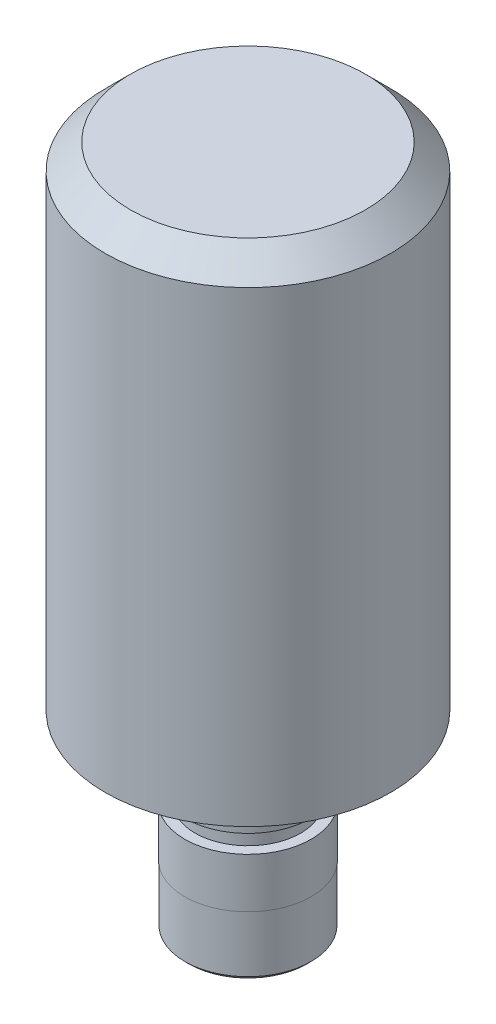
ISO-10303-21;
HEADER;
FILE_DESCRIPTION(('STEP AP214'),'2;1');
FILE_NAME('part.step','',(''),(''),'','','');
FILE_SCHEMA(('AUTOMOTIVE_DESIGN { 1 0 10303 214 1 1 1 1 }'));
ENDSEC;
DATA;
#1=APPLICATION_CONTEXT('core data for automotive mechanical design processes');
#2=APPLICATION_PROTOCOL_DEFINITION('international standard','automotive_design',2000,#1);
#3=PRODUCT_CONTEXT('',#1,'mechanical');
#4=PRODUCT('Part','Part','',(#3));
#5=PRODUCT_RELATED_PRODUCT_CATEGORY('part','',(#4));
#6=PRODUCT_DEFINITION_FORMATION('','',#4);
#7=PRODUCT_DEFINITION_CONTEXT('part definition',#1,'design');
#8=PRODUCT_DEFINITION('design','',#6,#7);
#9=PRODUCT_DEFINITION_SHAPE('','',#8);
#10=(LENGTH_UNIT() NAMED_UNIT(*) SI_UNIT(.MILLI.,.METRE.));
#11=(NAMED_UNIT(*) PLANE_ANGLE_UNIT() SI_UNIT($,.RADIAN.));
#12=(NAMED_UNIT(*) SI_UNIT($,.STERADIAN.) SOLID_ANGLE_UNIT());
#13=UNCERTAINTY_MEASURE_WITH_UNIT(LENGTH_MEASURE(1.E-05),#10,'distance_accuracy_value','');
#14=(GEOMETRIC_REPRESENTATION_CONTEXT(3) GLOBAL_UNCERTAINTY_ASSIGNED_CONTEXT((#13)) GLOBAL_UNIT_ASSIGNED_CONTEXT((#10,
#11,#12)) REPRESENTATION_CONTEXT('',''));
#15=CARTESIAN_POINT('',(0.,0.,0.));
#16=DIRECTION('',(0.,0.,1.));
#17=DIRECTION('',(1.,0.,0.));
#18=AXIS2_PLACEMENT_3D('',#15,#16,#17);
#19=CARTESIAN_POINT('',(0.,-78.4098,0.));
#20=DIRECTION('',(0.,1.,0.));
#21=DIRECTION('',(0.,0.,1.));
#22=AXIS2_PLACEMENT_3D('',#19,#20,#21);
#23=CYLINDRICAL_SURFACE('',#22,7.9756);
#24=CARTESIAN_POINT('',(0.,-69.85,0.));
#25=DIRECTION('',(0.,1.,0.));
#26=DIRECTION('',(0.,0.,1.));
#27=AXIS2_PLACEMENT_3D('',#24,#25,#26);
#28=CIRCLE('',#27,7.9756);
#29=CARTESIAN_POINT('',(0.,-69.85,7.9756));
#30=VERTEX_POINT('',#29);
#31=EDGE_CURVE('E100',#30,#30,#28,.T.);
#32=ORIENTED_EDGE('',*,*,#31,.T.);
#33=EDGE_LOOP('',(#32));
#34=FACE_BOUND('',#33,.T.);
#35=CARTESIAN_POINT('',(0.,-68.1228,0.));
#36=DIRECTION('',(0.,1.,0.));
#37=DIRECTION('',(0.,0.,1.));
#38=AXIS2_PLACEMENT_3D('',#35,#36,#37);
#39=CIRCLE('',#38,7.9756);
#40=CARTESIAN_POINT('',(0.,-68.1228,7.9756));
#41=VERTEX_POINT('',#40);
#42=EDGE_CURVE('E79',#41,#41,#39,.T.);
#43=ORIENTED_EDGE('',*,*,#42,.F.);
#44=EDGE_LOOP('',(#43));
#45=FACE_BOUND('',#44,.T.);
#46=ADVANCED_FACE('F32',(#34,#45),#23,.T.);
#47=CARTESIAN_POINT('',(0.,-68.1228,7.9756));
#48=DIRECTION('',(0.,-1.,0.));
#49=DIRECTION('',(0.,0.,-1.));
#50=AXIS2_PLACEMENT_3D('',#47,#48,#49);
#51=PLANE('',#50);
#52=CARTESIAN_POINT('',(0.,-68.1228,0.));
#53=DIRECTION('',(0.,1.,0.));
#54=DIRECTION('',(0.,0.,1.));
#55=AXIS2_PLACEMENT_3D('',#52,#53,#54);
#56=CIRCLE('',#55,6.6548);
#57=CARTESIAN_POINT('',(0.,-68.1228,6.6548));
#58=VERTEX_POINT('',#57);
#59=EDGE_CURVE('E82',#58,#58,#56,.T.);
#60=ORIENTED_EDGE('',*,*,#59,.F.);
#61=EDGE_LOOP('',(#60));
#62=FACE_BOUND('',#61,.T.);
#63=ORIENTED_EDGE('',*,*,#42,.T.);
#64=EDGE_LOOP('',(#63));
#65=FACE_BOUND('',#64,.T.);
#66=ADVANCED_FACE('F150',(#62,#65),#51,.F.);
#67=CARTESIAN_POINT('',(0.,2.40632840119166,0.));
#68=DIRECTION('',(0.,1.,0.));
#69=DIRECTION('',(0.,0.,1.));
#70=AXIS2_PLACEMENT_3D('',#67,#68,#69);
#71=CYLINDRICAL_SURFACE('',#70,6.6548);
#72=CARTESIAN_POINT('',(0.,-65.8368,0.));
#73=DIRECTION('',(0.,1.,0.));
#74=DIRECTION('',(0.,0.,1.));
#75=AXIS2_PLACEMENT_3D('',#72,#73,#74);
#76=CIRCLE('',#75,6.6548);
#77=CARTESIAN_POINT('',(0.,-65.8368,6.6548));
#78=VERTEX_POINT('',#77);
#79=EDGE_CURVE('E85',#78,#78,#76,.T.);
#80=ORIENTED_EDGE('',*,*,#79,.F.);
#81=EDGE_LOOP('',(#80));
#82=FACE_BOUND('',#81,.T.);
#83=ORIENTED_EDGE('',*,*,#59,.T.);
#84=EDGE_LOOP('',(#83));
#85=FACE_BOUND('',#84,.T.);
#86=ADVANCED_FACE('F154',(#82,#85),#71,.T.);
#87=CARTESIAN_POINT('',(0.,-65.8368,7.9756));
#88=DIRECTION('',(0.,1.,0.));
#89=DIRECTION('',(0.,0.,1.));
#90=AXIS2_PLACEMENT_3D('',#87,#88,#89);
#91=PLANE('',#90);
#92=CARTESIAN_POINT('',(0.,-65.8368,0.));
#93=DIRECTION('',(0.,1.,0.));
#94=DIRECTION('',(0.,0.,1.));
#95=AXIS2_PLACEMENT_3D('',#92,#93,#94);
#96=CIRCLE('',#95,7.9756);
#97=CARTESIAN_POINT('',(0.,-65.8368,7.9756));
#98=VERTEX_POINT('',#97);
#99=EDGE_CURVE('E88',#98,#98,#96,.T.);
#100=ORIENTED_EDGE('',*,*,#99,.F.);
#101=EDGE_LOOP('',(#100));
#102=FACE_BOUND('',#101,.T.);
#103=ORIENTED_EDGE('',*,*,#79,.T.);
#104=EDGE_LOOP('',(#103));
#105=FACE_BOUND('',#104,.T.);
#106=ADVANCED_FACE('F171',(#102,#105),#91,.F.);
#107=CARTESIAN_POINT('',(0.,0.,0.));
#108=DIRECTION('',(0.,1.,0.));
#109=DIRECTION('',(0.,0.,1.));
#110=AXIS2_PLACEMENT_3D('',#107,#108,#109);
#111=PLANE('',#110);
#112=CARTESIAN_POINT('',(0.,0.,0.));
#113=DIRECTION('',(0.,1.,0.));
#114=DIRECTION('',(0.,0.,1.));
#115=AXIS2_PLACEMENT_3D('',#112,#113,#114);
#116=CIRCLE('',#115,14.8209);
#117=CARTESIAN_POINT('',(0.,0.,14.8209));
#118=VERTEX_POINT('',#117);
#119=EDGE_CURVE('E58',#118,#118,#116,.T.);
#120=ORIENTED_EDGE('',*,*,#119,.T.);
#121=EDGE_LOOP('',(#120));
#122=FACE_BOUND('',#121,.T.);
#123=ADVANCED_FACE('F174',(#122),#111,.T.);
#124=CARTESIAN_POINT('',(0.,0.,0.));
#125=DIRECTION('',(0.,-1.,0.));
#126=DIRECTION('',(0.,0.,-1.));
#127=AXIS2_PLACEMENT_3D('',#124,#125,#126);
#128=CONICAL_SURFACE('',#127,14.8209,0.785398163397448);
#129=CARTESIAN_POINT('',(0.,-3.17500000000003,0.));
#130=DIRECTION('',(0.,1.,0.));
#131=DIRECTION('',(0.,0.,1.));
#132=AXIS2_PLACEMENT_3D('',#129,#130,#131);
#133=CIRCLE('',#132,17.9959);
#134=CARTESIAN_POINT('',(0.,-3.17500000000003,17.9959));
#135=VERTEX_POINT('',#134);
#136=EDGE_CURVE('E55',#135,#135,#133,.F.);
#137=ORIENTED_EDGE('',*,*,#136,.F.);
#138=EDGE_LOOP('',(#137));
#139=FACE_BOUND('',#138,.T.);
#140=ORIENTED_EDGE('',*,*,#119,.F.);
#141=EDGE_LOOP('',(#140));
#142=FACE_BOUND('',#141,.T.);
#143=ADVANCED_FACE('F190',(#139,#142),#128,.T.);
#144=CARTESIAN_POINT('',(0.,-60.7568,11.049));
#145=DIRECTION('',(0.,-1.,0.));
#146=DIRECTION('',(0.,0.,-1.));
#147=AXIS2_PLACEMENT_3D('',#144,#145,#146);
#148=PLANE('',#147);
#149=CARTESIAN_POINT('',(0.,-60.7568,11.049));
#150=DIRECTION('',(0.,-1.,0.));
#151=DIRECTION('',(0.,0.,-1.));
#152=AXIS2_PLACEMENT_3D('',#149,#150,#151);
#153=CIRCLE('',#152,1.9939);
#154=CARTESIAN_POINT('',(0.,-60.7568,9.0551));
#155=VERTEX_POINT('',#154);
#156=EDGE_CURVE('E73',#155,#155,#153,.T.);
#157=ORIENTED_EDGE('',*,*,#156,.T.);
#158=EDGE_LOOP('',(#157));
#159=FACE_BOUND('',#158,.T.);
#160=ADVANCED_FACE('F187',(#159),#148,.T.);
#161=CARTESIAN_POINT('',(0.,-62.0268,0.));
#162=DIRECTION('',(0.,1.,0.));
#163=DIRECTION('',(0.,0.,1.));
#164=AXIS2_PLACEMENT_3D('',#161,#162,#163);
#165=CYLINDRICAL_SURFACE('',#164,17.9959);
#166=CARTESIAN_POINT('',(0.,-62.0268,0.));
#167=DIRECTION('',(0.,1.,0.));
#168=DIRECTION('',(0.,0.,1.));
#169=AXIS2_PLACEMENT_3D('',#166,#167,#168);
#170=CIRCLE('',#169,17.9959);
#171=CARTESIAN_POINT('',(0.,-62.0268,17.9959));
#172=VERTEX_POINT('',#171);
#173=EDGE_CURVE('E61',#172,#172,#170,.T.);
#174=CARTESIAN_POINT('',(0.,-3.17500000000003,17.9959));
#175=CARTESIAN_POINT('',(0.,-3.78803958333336,17.9959));
#176=CARTESIAN_POINT('',(0.,-4.40107916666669,17.9959));
#177=CARTESIAN_POINT('',(0.,-5.62715833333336,17.9959));
#178=CARTESIAN_POINT('',(0.,-6.24019791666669,17.9959));
#179=CARTESIAN_POINT('',(0.,-7.46627708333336,17.9959));
#180=CARTESIAN_POINT('',(0.,-8.07931666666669,17.9959));
#181=CARTESIAN_POINT('',(0.,-9.30539583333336,17.9959));
#182=CARTESIAN_POINT('',(0.,-9.91843541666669,17.9959));
#183=CARTESIAN_POINT('',(0.,-11.1445145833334,17.9959));
#184=CARTESIAN_POINT('',(0.,-11.7575541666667,17.9959));
#185=CARTESIAN_POINT('',(0.,-12.9836333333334,17.9959));
#186=CARTESIAN_POINT('',(0.,-13.5966729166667,17.9959));
#187=CARTESIAN_POINT('',(0.,-14.8227520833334,17.9959));
#188=CARTESIAN_POINT('',(0.,-15.4357916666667,17.9959));
#189=CARTESIAN_POINT('',(0.,-16.6618708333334,17.9959));
#190=CARTESIAN_POINT('',(0.,-17.2749104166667,17.9959));
#191=CARTESIAN_POINT('',(0.,-18.5009895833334,17.9959));
#192=CARTESIAN_POINT('',(0.,-19.1140291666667,17.9959));
#193=CARTESIAN_POINT('',(0.,-20.3401083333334,17.9959));
#194=CARTESIAN_POINT('',(0.,-20.9531479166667,17.9959));
#195=CARTESIAN_POINT('',(0.,-22.1792270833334,17.9959));
#196=CARTESIAN_POINT('',(0.,-22.7922666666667,17.9959));
#197=CARTESIAN_POINT('',(0.,-24.0183458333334,17.9959));
#198=CARTESIAN_POINT('',(0.,-24.6313854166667,17.9959));
#199=CARTESIAN_POINT('',(0.,-25.8574645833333,17.9959));
#200=CARTESIAN_POINT('',(0.,-26.4705041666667,17.9959));
#201=CARTESIAN_POINT('',(0.,-27.6965833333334,17.9959));
#202=CARTESIAN_POINT('',(0.,-28.3096229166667,17.9959));
#203=CARTESIAN_POINT('',(0.,-29.5357020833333,17.9959));
#204=CARTESIAN_POINT('',(0.,-30.1487416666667,17.9959));
#205=CARTESIAN_POINT('',(0.,-31.3748208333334,17.9959));
#206=CARTESIAN_POINT('',(0.,-31.9878604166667,17.9959));
#207=CARTESIAN_POINT('',(0.,-33.2139395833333,17.9959));
#208=CARTESIAN_POINT('',(0.,-33.8269791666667,17.9959));
#209=CARTESIAN_POINT('',(0.,-35.0530583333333,17.9959));
#210=CARTESIAN_POINT('',(0.,-35.6660979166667,17.9959));
#211=CARTESIAN_POINT('',(0.,-36.8921770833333,17.9959));
#212=CARTESIAN_POINT('',(0.,-37.5052166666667,17.9959));
#213=CARTESIAN_POINT('',(0.,-38.7312958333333,17.9959));
#214=CARTESIAN_POINT('',(0.,-39.3443354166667,17.9959));
#215=CARTESIAN_POINT('',(0.,-40.5704145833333,17.9959));
#216=CARTESIAN_POINT('',(0.,-41.1834541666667,17.9959));
#217=CARTESIAN_POINT('',(0.,-42.4095333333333,17.9959));
#218=CARTESIAN_POINT('',(0.,-43.0225729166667,17.9959));
#219=CARTESIAN_POINT('',(0.,-44.2486520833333,17.9959));
#220=CARTESIAN_POINT('',(0.,-44.8616916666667,17.9959));
#221=CARTESIAN_POINT('',(0.,-46.0877708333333,17.9959));
#222=CARTESIAN_POINT('',(0.,-46.7008104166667,17.9959));
#223=CARTESIAN_POINT('',(0.,-47.9268895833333,17.9959));
#224=CARTESIAN_POINT('',(0.,-48.5399291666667,17.9959));
#225=CARTESIAN_POINT('',(0.,-49.7660083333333,17.9959));
#226=CARTESIAN_POINT('',(0.,-50.3790479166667,17.9959));
#227=CARTESIAN_POINT('',(0.,-51.6051270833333,17.9959));
#228=CARTESIAN_POINT('',(0.,-52.2181666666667,17.9959));
#229=CARTESIAN_POINT('',(0.,-53.4442458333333,17.9959));
#230=CARTESIAN_POINT('',(0.,-54.0572854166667,17.9959));
#231=CARTESIAN_POINT('',(0.,-55.2833645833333,17.9959));
#232=CARTESIAN_POINT('',(0.,-55.8964041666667,17.9959));
#233=CARTESIAN_POINT('',(0.,-57.1224833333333,17.9959));
#234=CARTESIAN_POINT('',(0.,-57.7355229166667,17.9959));
#235=CARTESIAN_POINT('',(0.,-58.9616020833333,17.9959));
#236=CARTESIAN_POINT('',(0.,-59.5746416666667,17.9959));
#237=CARTESIAN_POINT('',(0.,-60.8007208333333,17.9959));
#238=CARTESIAN_POINT('',(0.,-61.4137604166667,17.9959));
#239=CARTESIAN_POINT('',(0.,-62.0268,17.9959));
#240=B_SPLINE_CURVE_WITH_KNOTS('',3,(#174,#175,#176,#177,#178,#179,#180,#181,#182,#183,#184,
#185,#186,#187,#188,#189,#190,#191,#192,#193,#194,#195,#196,#197,#198,#199,#200,#201,#202,#203,
#204,#205,#206,#207,#208,#209,#210,#211,#212,#213,#214,#215,#216,#217,#218,#219,#220,#221,#222,
#223,#224,#225,#226,#227,#228,#229,#230,#231,#232,#233,#234,#235,#236,#237,#238,#239),
.UNSPECIFIED.,.F.,.F.,(4,2,2,2,2,2,2,2,2,2,2,2,2,2,2,2,2,2,2,2,2,2,2,2,2,2,2,2,2,2,2,2,4),(0.,
1.83911875,3.6782375,5.51735625,7.356475,9.19559375,11.0347125,12.87383125,14.71295,16.55206875,
18.3911875,20.23030625,22.069425,23.90854375,25.7476625,27.58678125,29.4259,31.26501875,
33.1041375,34.94325625,36.782375,38.62149375,40.4606125,42.29973125,44.13885,45.97796875,
47.8170875,49.65620625,51.495325,53.33444375,55.1735625,57.01268125,58.8518),.UNSPECIFIED.);
#241=EDGE_CURVE('BSEAM34',#135,#172,#240,.T.);
#242=ORIENTED_EDGE('',*,*,#136,.T.);
#243=ORIENTED_EDGE('',*,*,#173,.T.);
#244=ORIENTED_EDGE('',*,*,#241,.T.);
#245=ORIENTED_EDGE('',*,*,#241,.F.);
#246=EDGE_LOOP('',(#242,#244,#243,#245));
#247=FACE_BOUND('',#246,.T.);
#248=ADVANCED_FACE('F34',(#247),#165,.T.);
#249=CARTESIAN_POINT('',(0.,-60.7568,11.049));
#250=DIRECTION('',(0.,-1.,0.));
#251=DIRECTION('',(0.,0.,-1.));
#252=AXIS2_PLACEMENT_3D('',#249,#250,#251);
#253=CYLINDRICAL_SURFACE('',#252,1.9939);
#254=ORIENTED_EDGE('',*,*,#156,.F.);
#255=EDGE_LOOP('',(#254));
#256=FACE_BOUND('',#255,.T.);
#257=CARTESIAN_POINT('',(0.,-62.0268,11.049));
#258=DIRECTION('',(0.,-1.,0.));
#259=DIRECTION('',(0.,0.,-1.));
#260=AXIS2_PLACEMENT_3D('',#257,#258,#259);
#261=CIRCLE('',#260,1.9939);
#262=CARTESIAN_POINT('',(0.,-62.0268,9.0551));
#263=VERTEX_POINT('',#262);
#264=EDGE_CURVE('E76',#263,#263,#261,.T.);
#265=ORIENTED_EDGE('',*,*,#264,.T.);
#266=EDGE_LOOP('',(#265));
#267=FACE_BOUND('',#266,.T.);
#268=ADVANCED_FACE('F164',(#256,#267),#253,.F.);
#269=CARTESIAN_POINT('',(0.,-62.0268,0.));
#270=DIRECTION('',(0.,1.,0.));
#271=DIRECTION('',(0.,0.,1.));
#272=AXIS2_PLACEMENT_3D('',#269,#270,#271);
#273=PLANE('',#272);
#274=ORIENTED_EDGE('',*,*,#264,.F.);
#275=EDGE_LOOP('',(#274));
#276=FACE_BOUND('',#275,.T.);
#277=ORIENTED_EDGE('',*,*,#173,.F.);
#278=EDGE_LOOP('',(#277));
#279=FACE_BOUND('',#278,.T.);
#280=CARTESIAN_POINT('',(0.,-62.0268,0.));
#281=DIRECTION('',(0.,1.,0.));
#282=DIRECTION('',(0.,0.,1.));
#283=AXIS2_PLACEMENT_3D('',#280,#281,#282);
#284=CIRCLE('',#283,7.9756);
#285=CARTESIAN_POINT('',(0.,-62.0268,7.9756));
#286=VERTEX_POINT('',#285);
#287=EDGE_CURVE('E52',#286,#286,#284,.F.);
#288=ORIENTED_EDGE('',*,*,#287,.F.);
#289=EDGE_LOOP('',(#288));
#290=FACE_BOUND('',#289,.T.);
#291=ADVANCED_FACE('F159',(#276,#279,#290),#273,.F.);
#292=ORIENTED_EDGE('',*,*,#99,.T.);
#293=EDGE_LOOP('',(#292));
#294=FACE_BOUND('',#293,.T.);
#295=ORIENTED_EDGE('',*,*,#287,.T.);
#296=EDGE_LOOP('',(#295));
#297=FACE_BOUND('',#296,.T.);
#298=ADVANCED_FACE('F122',(#294,#297),#23,.T.);
#299=CARTESIAN_POINT('',(0.,-72.136,7.9756));
#300=DIRECTION('',(0.,-1.,0.));
#301=DIRECTION('',(0.,0.,-1.));
#302=AXIS2_PLACEMENT_3D('',#299,#300,#301);
#303=PLANE('',#302);
#304=CARTESIAN_POINT('',(0.,-72.136,0.));
#305=DIRECTION('',(0.,1.,0.));
#306=DIRECTION('',(0.,0.,1.));
#307=AXIS2_PLACEMENT_3D('',#304,#305,#306);
#308=CIRCLE('',#307,6.6548);
#309=CARTESIAN_POINT('',(0.,-72.136,6.6548));
#310=VERTEX_POINT('',#309);
#311=EDGE_CURVE('E94',#310,#310,#308,.T.);
#312=ORIENTED_EDGE('',*,*,#311,.F.);
#313=EDGE_LOOP('',(#312));
#314=FACE_BOUND('',#313,.T.);
#315=CARTESIAN_POINT('',(0.,-72.136,0.));
#316=DIRECTION('',(0.,1.,0.));
#317=DIRECTION('',(0.,0.,1.));
#318=AXIS2_PLACEMENT_3D('',#315,#316,#317);
#319=CIRCLE('',#318,7.9756);
#320=CARTESIAN_POINT('',(0.,-72.136,7.9756));
#321=VERTEX_POINT('',#320);
#322=EDGE_CURVE('E91',#321,#321,#319,.T.);
#323=ORIENTED_EDGE('',*,*,#322,.T.);
#324=EDGE_LOOP('',(#323));
#325=FACE_BOUND('',#324,.T.);
#326=ADVANCED_FACE('F116',(#314,#325),#303,.F.);
#327=CARTESIAN_POINT('',(0.,2.40632840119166,0.));
#328=DIRECTION('',(0.,1.,0.));
#329=DIRECTION('',(0.,0.,1.));
#330=AXIS2_PLACEMENT_3D('',#327,#328,#329);
#331=CYLINDRICAL_SURFACE('',#330,6.6548);
#332=CARTESIAN_POINT('',(0.,-69.85,0.));
#333=DIRECTION('',(0.,1.,0.));
#334=DIRECTION('',(0.,0.,1.));
#335=AXIS2_PLACEMENT_3D('',#332,#333,#334);
#336=CIRCLE('',#335,6.6548);
#337=CARTESIAN_POINT('',(0.,-69.85,6.6548));
#338=VERTEX_POINT('',#337);
#339=EDGE_CURVE('E97',#338,#338,#336,.T.);
#340=ORIENTED_EDGE('',*,*,#339,.F.);
#341=EDGE_LOOP('',(#340));
#342=FACE_BOUND('',#341,.T.);
#343=ORIENTED_EDGE('',*,*,#311,.T.);
#344=EDGE_LOOP('',(#343));
#345=FACE_BOUND('',#344,.T.);
#346=ADVANCED_FACE('F110',(#342,#345),#331,.T.);
#347=CARTESIAN_POINT('',(0.,-69.85,7.9756));
#348=DIRECTION('',(0.,1.,0.));
#349=DIRECTION('',(0.,0.,1.));
#350=AXIS2_PLACEMENT_3D('',#347,#348,#349);
#351=PLANE('',#350);
#352=ORIENTED_EDGE('',*,*,#31,.F.);
#353=EDGE_LOOP('',(#352));
#354=FACE_BOUND('',#353,.T.);
#355=ORIENTED_EDGE('',*,*,#339,.T.);
#356=EDGE_LOOP('',(#355));
#357=FACE_BOUND('',#356,.T.);
#358=ADVANCED_FACE('F106',(#354,#357),#351,.F.);
#359=CARTESIAN_POINT('',(0.,-75.1078,0.));
#360=DIRECTION('',(0.,-1.,0.));
#361=DIRECTION('',(0.,0.,-1.));
#362=AXIS2_PLACEMENT_3D('',#359,#360,#361);
#363=PLANE('',#362);
#364=CARTESIAN_POINT('',(0.,-75.1078,0.));
#365=DIRECTION('',(0.,-1.,0.));
#366=DIRECTION('',(0.,0.,-1.));
#367=AXIS2_PLACEMENT_3D('',#364,#365,#366);
#368=CIRCLE('',#367,6.0325);
#369=CARTESIAN_POINT('',(0.,-75.1078,-6.0325));
#370=VERTEX_POINT('',#369);
#371=EDGE_CURVE('E70',#370,#370,#368,.T.);
#372=ORIENTED_EDGE('',*,*,#371,.T.);
#373=EDGE_LOOP('',(#372));
#374=FACE_BOUND('',#373,.T.);
#375=ADVANCED_FACE('F109',(#374),#363,.T.);
#376=CARTESIAN_POINT('',(0.,-75.1078,0.));
#377=DIRECTION('',(0.,-1.,0.));
#378=DIRECTION('',(0.,0.,-1.));
#379=AXIS2_PLACEMENT_3D('',#376,#377,#378);
#380=CYLINDRICAL_SURFACE('',#379,6.0325);
#381=CARTESIAN_POINT('',(0.,-85.5218,0.));
#382=DIRECTION('',(0.,-1.,0.));
#383=DIRECTION('',(0.,0.,-1.));
#384=AXIS2_PLACEMENT_3D('',#381,#382,#383);
#385=CIRCLE('',#384,6.0325);
#386=CARTESIAN_POINT('',(0.,-85.5218,-6.0325));
#387=VERTEX_POINT('',#386);
#388=EDGE_CURVE('E10',#387,#387,#385,.T.);
#389=ORIENTED_EDGE('',*,*,#388,.T.);
#390=EDGE_LOOP('',(#389));
#391=FACE_BOUND('',#390,.T.);
#392=ORIENTED_EDGE('',*,*,#371,.F.);
#393=EDGE_LOOP('',(#392));
#394=FACE_BOUND('',#393,.T.);
#395=ADVANCED_FACE('F197',(#391,#394),#380,.F.);
#396=CARTESIAN_POINT('',(0.,-85.5218,0.));
#397=DIRECTION('',(0.,-1.,0.));
#398=DIRECTION('',(0.,0.,-1.));
#399=AXIS2_PLACEMENT_3D('',#396,#397,#398);
#400=CONICAL_SURFACE('',#399,6.0325,0.785398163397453);
#401=CARTESIAN_POINT('',(0.,-86.0298,0.));
#402=DIRECTION('',(0.,-1.,0.));
#403=DIRECTION('',(0.,0.,-1.));
#404=AXIS2_PLACEMENT_3D('',#401,#402,#403);
#405=CIRCLE('',#404,6.5405);
#406=CARTESIAN_POINT('',(0.,-86.0298,-6.5405));
#407=VERTEX_POINT('',#406);
#408=EDGE_CURVE('E47',#407,#407,#405,.F.);
#409=ORIENTED_EDGE('',*,*,#408,.F.);
#410=EDGE_LOOP('',(#409));
#411=FACE_BOUND('',#410,.T.);
#412=ORIENTED_EDGE('',*,*,#388,.F.);
#413=EDGE_LOOP('',(#412));
#414=FACE_BOUND('',#413,.T.);
#415=ADVANCED_FACE('F195',(#411,#414),#400,.F.);
#416=CARTESIAN_POINT('',(0.,-86.0298,0.));
#417=DIRECTION('',(0.,-1.,0.));
#418=DIRECTION('',(0.,0.,-1.));
#419=AXIS2_PLACEMENT_3D('',#416,#417,#418);
#420=PLANE('',#419);
#421=CARTESIAN_POINT('',(0.,-86.0298,0.));
#422=DIRECTION('',(0.,-1.,0.));
#423=DIRECTION('',(0.,0.,-1.));
#424=AXIS2_PLACEMENT_3D('',#421,#422,#423);
#425=CIRCLE('',#424,7.42950000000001);
#426=CARTESIAN_POINT('',(0.,-86.0298,-7.42950000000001));
#427=VERTEX_POINT('',#426);
#428=EDGE_CURVE('E43',#427,#427,#425,.T.);
#429=ORIENTED_EDGE('',*,*,#428,.T.);
#430=EDGE_LOOP('',(#429));
#431=FACE_BOUND('',#430,.T.);
#432=ORIENTED_EDGE('',*,*,#408,.T.);
#433=EDGE_LOOP('',(#432));
#434=FACE_BOUND('',#433,.T.);
#435=ADVANCED_FACE('F145',(#431,#434),#420,.T.);
#436=CARTESIAN_POINT('',(0.,-86.0298,0.));
#437=DIRECTION('',(0.,1.,0.));
#438=DIRECTION('',(0.,0.,1.));
#439=AXIS2_PLACEMENT_3D('',#436,#437,#438);
#440=CONICAL_SURFACE('',#439,7.42950000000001,0.785398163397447);
#441=CARTESIAN_POINT('',(0.,-85.5218,0.));
#442=DIRECTION('',(0.,-1.,0.));
#443=DIRECTION('',(0.,0.,-1.));
#444=AXIS2_PLACEMENT_3D('',#441,#442,#443);
#445=CIRCLE('',#444,7.9375);
#446=CARTESIAN_POINT('',(0.,-85.5218,7.9375));
#447=VERTEX_POINT('',#446);
#448=EDGE_CURVE('E39',#447,#447,#445,.F.);
#449=ORIENTED_EDGE('',*,*,#448,.F.);
#450=EDGE_LOOP('',(#449));
#451=FACE_BOUND('',#450,.T.);
#452=ORIENTED_EDGE('',*,*,#428,.F.);
#453=EDGE_LOOP('',(#452));
#454=FACE_BOUND('',#453,.T.);
#455=ADVANCED_FACE('F140',(#451,#454),#440,.T.);
#456=CARTESIAN_POINT('',(0.,-86.0298,0.));
#457=DIRECTION('',(0.,1.,0.));
#458=DIRECTION('',(0.,0.,1.));
#459=AXIS2_PLACEMENT_3D('',#456,#457,#458);
#460=CYLINDRICAL_SURFACE('',#459,7.9375);
#461=CARTESIAN_POINT('',(0.,-78.4098,0.));
#462=DIRECTION('',(0.,-1.,0.));
#463=DIRECTION('',(0.,0.,-1.));
#464=AXIS2_PLACEMENT_3D('',#461,#462,#463);
#465=CIRCLE('',#464,7.9375);
#466=CARTESIAN_POINT('',(0.,-78.4098,7.9375));
#467=VERTEX_POINT('',#466);
#468=EDGE_CURVE('E67',#467,#467,#465,.T.);
#469=CARTESIAN_POINT('',(0.,-85.5218,7.9375));
#470=CARTESIAN_POINT('',(0.,-85.4477166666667,7.9375));
#471=CARTESIAN_POINT('',(0.,-85.3736333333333,7.9375));
#472=CARTESIAN_POINT('',(0.,-85.2254666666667,7.9375));
#473=CARTESIAN_POINT('',(0.,-85.1513833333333,7.9375));
#474=CARTESIAN_POINT('',(0.,-85.0032166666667,7.9375));
#475=CARTESIAN_POINT('',(0.,-84.9291333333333,7.9375));
#476=CARTESIAN_POINT('',(0.,-84.7809666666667,7.9375));
#477=CARTESIAN_POINT('',(0.,-84.7068833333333,7.9375));
#478=CARTESIAN_POINT('',(0.,-84.5587166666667,7.9375));
#479=CARTESIAN_POINT('',(0.,-84.4846333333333,7.9375));
#480=CARTESIAN_POINT('',(0.,-84.3364666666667,7.9375));
#481=CARTESIAN_POINT('',(0.,-84.2623833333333,7.9375));
#482=CARTESIAN_POINT('',(0.,-84.1142166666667,7.9375));
#483=CARTESIAN_POINT('',(0.,-84.0401333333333,7.9375));
#484=CARTESIAN_POINT('',(0.,-83.8919666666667,7.9375));
#485=CARTESIAN_POINT('',(0.,-83.8178833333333,7.9375));
#486=CARTESIAN_POINT('',(0.,-83.6697166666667,7.9375));
#487=CARTESIAN_POINT('',(0.,-83.5956333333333,7.9375));
#488=CARTESIAN_POINT('',(0.,-83.4474666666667,7.9375));
#489=CARTESIAN_POINT('',(0.,-83.3733833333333,7.9375));
#490=CARTESIAN_POINT('',(0.,-83.2252166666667,7.9375));
#491=CARTESIAN_POINT('',(0.,-83.1511333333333,7.9375));
#492=CARTESIAN_POINT('',(0.,-83.0029666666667,7.9375));
#493=CARTESIAN_POINT('',(0.,-82.9288833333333,7.9375));
#494=CARTESIAN_POINT('',(0.,-82.7807166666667,7.9375));
#495=CARTESIAN_POINT('',(0.,-82.7066333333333,7.9375));
#496=CARTESIAN_POINT('',(0.,-82.5584666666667,7.9375));
#497=CARTESIAN_POINT('',(0.,-82.4843833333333,7.9375));
#498=CARTESIAN_POINT('',(0.,-82.3362166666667,7.9375));
#499=CARTESIAN_POINT('',(0.,-82.2621333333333,7.9375));
#500=CARTESIAN_POINT('',(0.,-82.1139666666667,7.9375));
#501=CARTESIAN_POINT('',(0.,-82.0398833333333,7.9375));
#502=CARTESIAN_POINT('',(0.,-81.8917166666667,7.9375));
#503=CARTESIAN_POINT('',(0.,-81.8176333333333,7.9375));
#504=CARTESIAN_POINT('',(0.,-81.6694666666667,7.9375));
#505=CARTESIAN_POINT('',(0.,-81.5953833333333,7.9375));
#506=CARTESIAN_POINT('',(0.,-81.4472166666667,7.9375));
#507=CARTESIAN_POINT('',(0.,-81.3731333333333,7.9375));
#508=CARTESIAN_POINT('',(0.,-81.2249666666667,7.9375));
#509=CARTESIAN_POINT('',(0.,-81.1508833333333,7.9375));
#510=CARTESIAN_POINT('',(0.,-81.0027166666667,7.9375));
#511=CARTESIAN_POINT('',(0.,-80.9286333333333,7.9375));
#512=CARTESIAN_POINT('',(0.,-80.7804666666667,7.9375));
#513=CARTESIAN_POINT('',(0.,-80.7063833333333,7.9375));
#514=CARTESIAN_POINT('',(0.,-80.5582166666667,7.9375));
#515=CARTESIAN_POINT('',(0.,-80.4841333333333,7.9375));
#516=CARTESIAN_POINT('',(0.,-80.3359666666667,7.9375));
#517=CARTESIAN_POINT('',(0.,-80.2618833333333,7.9375));
#518=CARTESIAN_POINT('',(0.,-80.1137166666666,7.9375));
#519=CARTESIAN_POINT('',(0.,-80.0396333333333,7.9375));
#520=CARTESIAN_POINT('',(0.,-79.8914666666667,7.9375));
#521=CARTESIAN_POINT('',(0.,-79.8173833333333,7.9375));
#522=CARTESIAN_POINT('',(0.,-79.6692166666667,7.9375));
#523=CARTESIAN_POINT('',(0.,-79.5951333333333,7.9375));
#524=CARTESIAN_POINT('',(0.,-79.4469666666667,7.9375));
#525=CARTESIAN_POINT('',(0.,-79.3728833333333,7.9375));
#526=CARTESIAN_POINT('',(0.,-79.2247166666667,7.9375));
#527=CARTESIAN_POINT('',(0.,-79.1506333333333,7.9375));
#528=CARTESIAN_POINT('',(0.,-79.0024666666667,7.9375));
#529=CARTESIAN_POINT('',(0.,-78.9283833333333,7.9375));
#530=CARTESIAN_POINT('',(0.,-78.7802166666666,7.9375));
#531=CARTESIAN_POINT('',(0.,-78.7061333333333,7.9375));
#532=CARTESIAN_POINT('',(0.,-78.5579666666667,7.9375));
#533=CARTESIAN_POINT('',(0.,-78.4838833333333,7.9375));
#534=CARTESIAN_POINT('',(0.,-78.4098,7.9375));
#535=B_SPLINE_CURVE_WITH_KNOTS('',3,(#469,#470,#471,#472,#473,#474,#475,#476,#477,#478,#479,
#480,#481,#482,#483,#484,#485,#486,#487,#488,#489,#490,#491,#492,#493,#494,#495,#496,#497,#498,
#499,#500,#501,#502,#503,#504,#505,#506,#507,#508,#509,#510,#511,#512,#513,#514,#515,#516,#517,
#518,#519,#520,#521,#522,#523,#524,#525,#526,#527,#528,#529,#530,#531,#532,#533,#534),
.UNSPECIFIED.,.F.,.F.,(4,2,2,2,2,2,2,2,2,2,2,2,2,2,2,2,2,2,2,2,2,2,2,2,2,2,2,2,2,2,2,2,4),(0.,
0.222249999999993,0.4445,0.666749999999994,0.889000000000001,1.11124999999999,1.3335,
1.55574999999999,1.778,2.00024999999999,2.2225,2.44475,2.667,2.88925,3.1115,3.33375,
3.55599999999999,3.77825,4.0005,4.22275,4.44499999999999,4.66725,4.88950000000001,5.11175,5.334,
5.55625,5.77850000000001,6.00075,6.22300000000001,6.44525,6.66750000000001,6.88975,
7.11200000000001),.UNSPECIFIED.);
#536=EDGE_CURVE('BSEAM135',#447,#467,#535,.T.);
#537=ORIENTED_EDGE('',*,*,#448,.T.);
#538=ORIENTED_EDGE('',*,*,#468,.T.);
#539=ORIENTED_EDGE('',*,*,#536,.T.);
#540=ORIENTED_EDGE('',*,*,#536,.F.);
#541=EDGE_LOOP('',(#537,#539,#538,#540));
#542=FACE_BOUND('',#541,.T.);
#543=ADVANCED_FACE('F135',(#542),#460,.T.);
#544=CARTESIAN_POINT('',(0.,-78.4098,0.));
#545=DIRECTION('',(0.,-1.,0.));
#546=DIRECTION('',(0.,0.,-1.));
#547=AXIS2_PLACEMENT_3D('',#544,#545,#546);
#548=PLANE('',#547);
#549=CARTESIAN_POINT('',(0.,-78.4098,0.));
#550=DIRECTION('',(0.,-1.,0.));
#551=DIRECTION('',(0.,0.,-1.));
#552=AXIS2_PLACEMENT_3D('',#549,#550,#551);
#553=CIRCLE('',#552,7.9756);
#554=CARTESIAN_POINT('',(0.,-78.4098,-7.9756));
#555=VERTEX_POINT('',#554);
#556=EDGE_CURVE('E64',#555,#555,#553,.T.);
#557=ORIENTED_EDGE('',*,*,#556,.T.);
#558=EDGE_LOOP('',(#557));
#559=FACE_BOUND('',#558,.T.);
#560=ORIENTED_EDGE('',*,*,#468,.F.);
#561=EDGE_LOOP('',(#560));
#562=FACE_BOUND('',#561,.T.);
#563=ADVANCED_FACE('F129',(#559,#562),#548,.T.);
#564=ORIENTED_EDGE('',*,*,#322,.F.);
#565=EDGE_LOOP('',(#564));
#566=FACE_BOUND('',#565,.T.);
#567=ORIENTED_EDGE('',*,*,#556,.F.);
#568=EDGE_LOOP('',(#567));
#569=FACE_BOUND('',#568,.T.);
#570=ADVANCED_FACE('F126',(#566,#569),#23,.T.);
#571=CLOSED_SHELL('',(#46,#66,#86,#106,#123,#143,#160,#248,#268,#291,#298,#326,#346,#358,#375,
#395,#415,#435,#455,#543,#563,#570));
#572=MANIFOLD_SOLID_BREP('B2',#571);
#573=ADVANCED_BREP_SHAPE_REPRESENTATION('',(#18,#572),#14);
#574=SHAPE_DEFINITION_REPRESENTATION(#9,#573);
ENDSEC;
END-ISO-10303-21;
